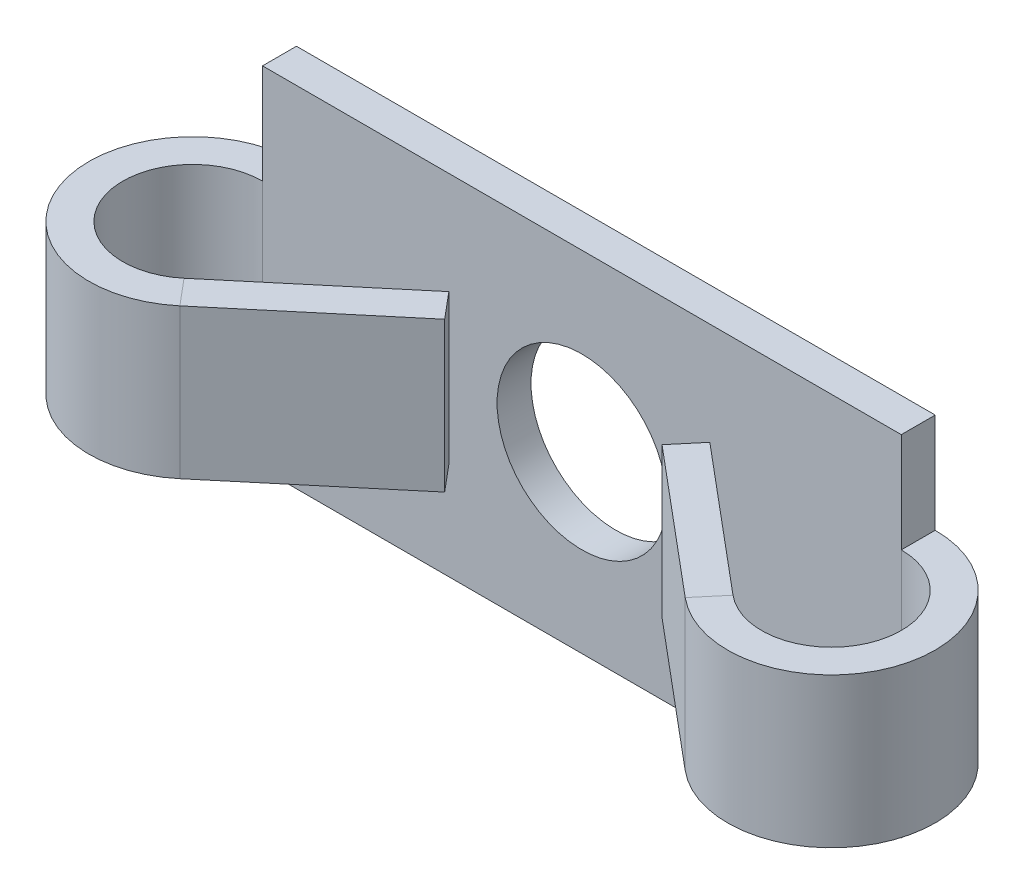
ISO-10303-21;
HEADER;
FILE_DESCRIPTION(('STEP AP214'),'2;1');
FILE_NAME('part.step','',(''),(''),'','','');
FILE_SCHEMA(('AUTOMOTIVE_DESIGN { 1 0 10303 214 1 1 1 1 }'));
ENDSEC;
DATA;
#1=APPLICATION_CONTEXT('core data for automotive mechanical design processes');
#2=APPLICATION_PROTOCOL_DEFINITION('international standard','automotive_design',2000,#1);
#3=PRODUCT_CONTEXT('',#1,'mechanical');
#4=PRODUCT('Part','Part','',(#3));
#5=PRODUCT_RELATED_PRODUCT_CATEGORY('part','',(#4));
#6=PRODUCT_DEFINITION_FORMATION('','',#4);
#7=PRODUCT_DEFINITION_CONTEXT('part definition',#1,'design');
#8=PRODUCT_DEFINITION('design','',#6,#7);
#9=PRODUCT_DEFINITION_SHAPE('','',#8);
#10=(LENGTH_UNIT() NAMED_UNIT(*) SI_UNIT(.MILLI.,.METRE.));
#11=(NAMED_UNIT(*) PLANE_ANGLE_UNIT() SI_UNIT($,.RADIAN.));
#12=(NAMED_UNIT(*) SI_UNIT($,.STERADIAN.) SOLID_ANGLE_UNIT());
#13=UNCERTAINTY_MEASURE_WITH_UNIT(LENGTH_MEASURE(1.E-05),#10,'distance_accuracy_value','');
#14=(GEOMETRIC_REPRESENTATION_CONTEXT(3) GLOBAL_UNCERTAINTY_ASSIGNED_CONTEXT((#13)) GLOBAL_UNIT_ASSIGNED_CONTEXT((#10,
#11,#12)) REPRESENTATION_CONTEXT('',''));
#15=CARTESIAN_POINT('',(0.,0.,0.));
#16=DIRECTION('',(0.,0.,1.));
#17=DIRECTION('',(1.,0.,0.));
#18=AXIS2_PLACEMENT_3D('',#15,#16,#17);
#19=CARTESIAN_POINT('',(-5.44429898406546,0.,1.43083307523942));
#20=DIRECTION('',(-0.766044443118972,0.,0.642787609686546));
#21=DIRECTION('',(0.,-1.,0.));
#22=AXIS2_PLACEMENT_3D('',#19,#20,#21);
#23=PLANE('',#22);
#24=DIRECTION('',(0.,1.,0.));
#25=VECTOR('',#24,1.);
#26=CARTESIAN_POINT('',(-6.53703792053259,0.,0.128557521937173));
#27=LINE('',#26,#25);
#28=CARTESIAN_POINT('',(-6.53703792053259,3.75,0.128557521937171));
#29=VERTEX_POINT('',#28);
#30=CARTESIAN_POINT('',(-6.53703792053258,-3.75,0.12855752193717));
#31=VERTEX_POINT('',#30);
#32=EDGE_CURVE('E188',#29,#31,#27,.F.);
#33=ORIENTED_EDGE('',*,*,#32,.F.);
#34=DIRECTION('',(-0.642787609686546,0.,-0.766044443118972));
#35=VECTOR('',#34,1.);
#36=CARTESIAN_POINT('',(-6.53703792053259,3.75,0.128557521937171));
#37=LINE('',#36,#35);
#38=CARTESIAN_POINT('',(-5.44429898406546,3.75,1.43083307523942));
#39=VERTEX_POINT('',#38);
#40=EDGE_CURVE('E174',#29,#39,#37,.F.);
#41=ORIENTED_EDGE('',*,*,#40,.T.);
#42=DIRECTION('',(0.,-1.,0.));
#43=VECTOR('',#42,1.);
#44=CARTESIAN_POINT('',(-5.44429898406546,0.,1.43083307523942));
#45=LINE('',#44,#43);
#46=CARTESIAN_POINT('',(-5.44429898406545,-3.75,1.43083307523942));
#47=VERTEX_POINT('',#46);
#48=EDGE_CURVE('E182',#39,#47,#45,.T.);
#49=ORIENTED_EDGE('',*,*,#48,.T.);
#50=DIRECTION('',(0.642787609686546,0.,0.766044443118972));
#51=VECTOR('',#50,1.);
#52=CARTESIAN_POINT('',(-5.44429898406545,-3.75,1.43083307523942));
#53=LINE('',#52,#51);
#54=EDGE_CURVE('E620',#47,#31,#53,.F.);
#55=ORIENTED_EDGE('',*,*,#54,.T.);
#56=EDGE_LOOP('',(#33,#41,#49,#55));
#57=FACE_BOUND('',#56,.T.);
#58=ADVANCED_FACE('F35',(#57),#23,.F.);
#59=CARTESIAN_POINT('',(-9.05090170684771,0.,4.45713208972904));
#60=DIRECTION('',(0.642787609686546,0.,0.766044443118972));
#61=DIRECTION('',(0.766044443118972,0.,-0.642787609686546));
#62=AXIS2_PLACEMENT_3D('',#59,#60,#61);
#63=PLANE('',#62);
#64=ORIENTED_EDGE('',*,*,#48,.F.);
#65=DIRECTION('',(0.766044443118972,0.,-0.642787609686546));
#66=VECTOR('',#65,1.);
#67=CARTESIAN_POINT('',(-9.05090170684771,3.75,4.45713208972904));
#68=LINE('',#67,#66);
#69=CARTESIAN_POINT('',(-12.65750442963,3.75,7.48343110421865));
#70=VERTEX_POINT('',#69);
#71=EDGE_CURVE('E170',#70,#39,#68,.T.);
#72=ORIENTED_EDGE('',*,*,#71,.F.);
#73=DIRECTION('',(0.,1.,0.));
#74=VECTOR('',#73,1.);
#75=CARTESIAN_POINT('',(-12.65750442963,0.,7.48343110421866));
#76=LINE('',#75,#74);
#77=CARTESIAN_POINT('',(-12.65750442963,-3.75,7.48343110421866));
#78=VERTEX_POINT('',#77);
#79=EDGE_CURVE('E181',#78,#70,#76,.T.);
#80=ORIENTED_EDGE('',*,*,#79,.F.);
#81=DIRECTION('',(-0.766044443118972,0.,0.642787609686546));
#82=VECTOR('',#81,1.);
#83=CARTESIAN_POINT('',(-9.05090170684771,-3.75,4.45713208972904));
#84=LINE('',#83,#82);
#85=EDGE_CURVE('E664',#47,#78,#84,.T.);
#86=ORIENTED_EDGE('',*,*,#85,.F.);
#87=EDGE_LOOP('',(#64,#72,#80,#86));
#88=FACE_BOUND('',#87,.T.);
#89=ADVANCED_FACE('F179',(#88),#63,.T.);
#90=CARTESIAN_POINT('',(-10.1436406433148,0.,3.15485653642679));
#91=DIRECTION('',(0.642787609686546,0.,0.766044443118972));
#92=DIRECTION('',(0.766044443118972,0.,-0.642787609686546));
#93=AXIS2_PLACEMENT_3D('',#90,#91,#92);
#94=PLANE('',#93);
#95=DIRECTION('',(0.766044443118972,0.,-0.642787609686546));
#96=VECTOR('',#95,1.);
#97=CARTESIAN_POINT('',(-10.1436406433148,3.75,3.15485653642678));
#98=LINE('',#97,#96);
#99=CARTESIAN_POINT('',(-13.7502433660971,3.75,6.1811555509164));
#100=VERTEX_POINT('',#99);
#101=EDGE_CURVE('E173',#100,#29,#98,.T.);
#102=ORIENTED_EDGE('',*,*,#101,.T.);
#103=ORIENTED_EDGE('',*,*,#32,.T.);
#104=DIRECTION('',(0.766044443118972,0.,-0.642787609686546));
#105=VECTOR('',#104,1.);
#106=CARTESIAN_POINT('',(-10.1436406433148,-3.75,3.15485653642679));
#107=LINE('',#106,#105);
#108=CARTESIAN_POINT('',(-13.7502433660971,-3.75,6.18115555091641));
#109=VERTEX_POINT('',#108);
#110=EDGE_CURVE('E666',#31,#109,#107,.F.);
#111=ORIENTED_EDGE('',*,*,#110,.T.);
#112=DIRECTION('',(0.,1.,0.));
#113=VECTOR('',#112,1.);
#114=CARTESIAN_POINT('',(-13.7502433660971,0.,6.1811555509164));
#115=LINE('',#114,#113);
#116=EDGE_CURVE('E192',#109,#100,#115,.T.);
#117=ORIENTED_EDGE('',*,*,#116,.T.);
#118=EDGE_LOOP('',(#102,#103,#111,#117));
#119=FACE_BOUND('',#118,.T.);
#120=ADVANCED_FACE('F268',(#119),#94,.F.);
#121=CARTESIAN_POINT('',(-16.,-8.75,3.49999999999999));
#122=DIRECTION('',(0.,-1.,0.));
#123=DIRECTION('',(0.642787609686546,0.,0.766044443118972));
#124=AXIS2_PLACEMENT_3D('',#121,#122,#123);
#125=CYLINDRICAL_SURFACE('',#124,5.2);
#126=CARTESIAN_POINT('',(-16.,3.75,3.49999999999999));
#127=DIRECTION('',(0.,-1.,0.));
#128=DIRECTION('',(1.,0.,0.));
#129=AXIS2_PLACEMENT_3D('',#126,#127,#128);
#130=CIRCLE('',#129,5.2);
#131=CARTESIAN_POINT('',(-16.,3.75,-1.70000000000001));
#132=VERTEX_POINT('',#131);
#133=EDGE_CURVE('E153',#132,#70,#130,.F.);
#134=ORIENTED_EDGE('',*,*,#133,.F.);
#135=DIRECTION('',(0.,-1.,0.));
#136=VECTOR('',#135,1.);
#137=CARTESIAN_POINT('',(-16.,8.75,-1.7));
#138=LINE('',#137,#136);
#139=CARTESIAN_POINT('',(-16.,-3.75,-1.70000000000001));
#140=VERTEX_POINT('',#139);
#141=EDGE_CURVE('E207',#132,#140,#138,.T.);
#142=ORIENTED_EDGE('',*,*,#141,.T.);
#143=CARTESIAN_POINT('',(-16.,-3.75,3.49999999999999));
#144=DIRECTION('',(0.,1.,0.));
#145=DIRECTION('',(-1.,0.,0.));
#146=AXIS2_PLACEMENT_3D('',#143,#144,#145);
#147=CIRCLE('',#146,5.2);
#148=EDGE_CURVE('E186',#78,#140,#147,.F.);
#149=ORIENTED_EDGE('',*,*,#148,.F.);
#150=ORIENTED_EDGE('',*,*,#79,.T.);
#151=EDGE_LOOP('',(#134,#142,#149,#150));
#152=FACE_BOUND('',#151,.T.);
#153=ADVANCED_FACE('F184',(#152),#125,.T.);
#154=CARTESIAN_POINT('',(-16.,-8.75,3.49999999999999));
#155=DIRECTION('',(0.,-1.,0.));
#156=DIRECTION('',(0.642787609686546,0.,0.766044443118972));
#157=AXIS2_PLACEMENT_3D('',#154,#155,#156);
#158=CYLINDRICAL_SURFACE('',#157,3.5);
#159=DIRECTION('',(0.,-1.,0.));
#160=VECTOR('',#159,1.);
#161=CARTESIAN_POINT('',(-16.,8.75,0.));
#162=LINE('',#161,#160);
#163=CARTESIAN_POINT('',(-16.,3.75,0.));
#164=VERTEX_POINT('',#163);
#165=CARTESIAN_POINT('',(-16.,-3.75,0.));
#166=VERTEX_POINT('',#165);
#167=EDGE_CURVE('E201',#164,#166,#162,.T.);
#168=ORIENTED_EDGE('',*,*,#167,.F.);
#169=CARTESIAN_POINT('',(-16.,3.75,3.49999999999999));
#170=DIRECTION('',(0.,-1.,0.));
#171=DIRECTION('',(0.,0.,-1.));
#172=AXIS2_PLACEMENT_3D('',#169,#170,#171);
#173=CIRCLE('',#172,3.5);
#174=EDGE_CURVE('E164',#164,#100,#173,.F.);
#175=ORIENTED_EDGE('',*,*,#174,.T.);
#176=ORIENTED_EDGE('',*,*,#116,.F.);
#177=CARTESIAN_POINT('',(-16.,-3.75,3.49999999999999));
#178=DIRECTION('',(0.,-1.,0.));
#179=DIRECTION('',(0.,0.,-1.));
#180=AXIS2_PLACEMENT_3D('',#177,#178,#179);
#181=CIRCLE('',#180,3.5);
#182=EDGE_CURVE('E662',#109,#166,#181,.T.);
#183=ORIENTED_EDGE('',*,*,#182,.T.);
#184=EDGE_LOOP('',(#168,#175,#176,#183));
#185=FACE_BOUND('',#184,.T.);
#186=ADVANCED_FACE('F435',(#185),#158,.F.);
#187=CARTESIAN_POINT('',(5.44429898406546,0.,1.43083307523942));
#188=DIRECTION('',(0.766044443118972,0.,0.642787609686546));
#189=DIRECTION('',(0.,1.,0.));
#190=AXIS2_PLACEMENT_3D('',#187,#188,#189);
#191=PLANE('',#190);
#192=DIRECTION('',(0.,1.,0.));
#193=VECTOR('',#192,1.);
#194=CARTESIAN_POINT('',(5.44429898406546,0.,1.43083307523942));
#195=LINE('',#194,#193);
#196=CARTESIAN_POINT('',(5.44429898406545,-3.74999999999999,1.43083307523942));
#197=VERTEX_POINT('',#196);
#198=CARTESIAN_POINT('',(5.44429898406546,3.74999999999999,1.43083307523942));
#199=VERTEX_POINT('',#198);
#200=EDGE_CURVE('E197',#197,#199,#195,.T.);
#201=ORIENTED_EDGE('',*,*,#200,.T.);
#202=DIRECTION('',(-0.642787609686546,0.,0.766044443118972));
#203=VECTOR('',#202,1.);
#204=CARTESIAN_POINT('',(5.44429898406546,3.74999999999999,1.43083307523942));
#205=LINE('',#204,#203);
#206=CARTESIAN_POINT('',(6.53703792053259,3.74999999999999,0.128557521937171));
#207=VERTEX_POINT('',#206);
#208=EDGE_CURVE('E653',#199,#207,#205,.F.);
#209=ORIENTED_EDGE('',*,*,#208,.T.);
#210=DIRECTION('',(0.,1.,0.));
#211=VECTOR('',#210,1.);
#212=CARTESIAN_POINT('',(6.53703792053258,0.,0.128557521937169));
#213=LINE('',#212,#211);
#214=CARTESIAN_POINT('',(6.53703792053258,-3.74999999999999,0.128557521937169));
#215=VERTEX_POINT('',#214);
#216=EDGE_CURVE('E640',#215,#207,#213,.T.);
#217=ORIENTED_EDGE('',*,*,#216,.F.);
#218=DIRECTION('',(0.642787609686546,0.,-0.766044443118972));
#219=VECTOR('',#218,1.);
#220=CARTESIAN_POINT('',(6.53703792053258,-3.74999999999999,0.128557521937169));
#221=LINE('',#220,#219);
#222=EDGE_CURVE('E631',#215,#197,#221,.F.);
#223=ORIENTED_EDGE('',*,*,#222,.T.);
#224=EDGE_LOOP('',(#201,#209,#217,#223));
#225=FACE_BOUND('',#224,.T.);
#226=ADVANCED_FACE('F445',(#225),#191,.F.);
#227=CARTESIAN_POINT('',(9.05090170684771,0.,4.45713208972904));
#228=DIRECTION('',(-0.642787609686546,0.,0.766044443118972));
#229=DIRECTION('',(0.766044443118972,0.,0.642787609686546));
#230=AXIS2_PLACEMENT_3D('',#227,#228,#229);
#231=PLANE('',#230);
#232=DIRECTION('',(0.,-1.,0.));
#233=VECTOR('',#232,1.);
#234=CARTESIAN_POINT('',(12.65750442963,0.,7.48343110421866));
#235=LINE('',#234,#233);
#236=CARTESIAN_POINT('',(12.65750442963,3.74999999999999,7.48343110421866));
#237=VERTEX_POINT('',#236);
#238=CARTESIAN_POINT('',(12.65750442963,-3.74999999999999,7.48343110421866));
#239=VERTEX_POINT('',#238);
#240=EDGE_CURVE('E638',#237,#239,#235,.T.);
#241=ORIENTED_EDGE('',*,*,#240,.F.);
#242=DIRECTION('',(0.766044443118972,0.,0.642787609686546));
#243=VECTOR('',#242,1.);
#244=CARTESIAN_POINT('',(9.05090170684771,3.74999999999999,4.45713208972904));
#245=LINE('',#244,#243);
#246=EDGE_CURVE('E602',#199,#237,#245,.T.);
#247=ORIENTED_EDGE('',*,*,#246,.F.);
#248=ORIENTED_EDGE('',*,*,#200,.F.);
#249=DIRECTION('',(0.766044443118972,0.,0.642787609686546));
#250=VECTOR('',#249,1.);
#251=CARTESIAN_POINT('',(9.05090170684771,-3.74999999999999,4.45713208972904));
#252=LINE('',#251,#250);
#253=EDGE_CURVE('E626',#239,#197,#252,.F.);
#254=ORIENTED_EDGE('',*,*,#253,.F.);
#255=EDGE_LOOP('',(#241,#247,#248,#254));
#256=FACE_BOUND('',#255,.T.);
#257=ADVANCED_FACE('F456',(#256),#231,.T.);
#258=CARTESIAN_POINT('',(10.1436406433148,0.,3.15485653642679));
#259=DIRECTION('',(-0.642787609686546,0.,0.766044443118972));
#260=DIRECTION('',(0.766044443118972,0.,0.642787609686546));
#261=AXIS2_PLACEMENT_3D('',#258,#259,#260);
#262=PLANE('',#261);
#263=DIRECTION('',(0.766044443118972,0.,0.642787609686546));
#264=VECTOR('',#263,1.);
#265=CARTESIAN_POINT('',(10.1436406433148,3.74999999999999,3.15485653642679));
#266=LINE('',#265,#264);
#267=CARTESIAN_POINT('',(13.7502433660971,3.74999999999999,6.1811555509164));
#268=VERTEX_POINT('',#267);
#269=EDGE_CURVE('E645',#207,#268,#266,.T.);
#270=ORIENTED_EDGE('',*,*,#269,.T.);
#271=DIRECTION('',(0.,1.,0.));
#272=VECTOR('',#271,1.);
#273=CARTESIAN_POINT('',(13.7502433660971,0.,6.1811555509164));
#274=LINE('',#273,#272);
#275=CARTESIAN_POINT('',(13.7502433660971,-3.74999999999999,6.1811555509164));
#276=VERTEX_POINT('',#275);
#277=EDGE_CURVE('E598',#268,#276,#274,.F.);
#278=ORIENTED_EDGE('',*,*,#277,.T.);
#279=DIRECTION('',(-0.766044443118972,0.,-0.642787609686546));
#280=VECTOR('',#279,1.);
#281=CARTESIAN_POINT('',(10.1436406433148,-3.74999999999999,3.15485653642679));
#282=LINE('',#281,#280);
#283=EDGE_CURVE('E624',#276,#215,#282,.T.);
#284=ORIENTED_EDGE('',*,*,#283,.T.);
#285=ORIENTED_EDGE('',*,*,#216,.T.);
#286=EDGE_LOOP('',(#270,#278,#284,#285));
#287=FACE_BOUND('',#286,.T.);
#288=ADVANCED_FACE('F467',(#287),#262,.F.);
#289=CARTESIAN_POINT('',(16.,8.75,3.50000000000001));
#290=DIRECTION('',(0.,1.,0.));
#291=DIRECTION('',(-0.642787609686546,0.,0.766044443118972));
#292=AXIS2_PLACEMENT_3D('',#289,#290,#291);
#293=CYLINDRICAL_SURFACE('',#292,5.19999999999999);
#294=DIRECTION('',(0.,1.,0.));
#295=VECTOR('',#294,1.);
#296=CARTESIAN_POINT('',(16.,8.75,-1.7));
#297=LINE('',#296,#295);
#298=CARTESIAN_POINT('',(16.,-3.74999999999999,-1.69999999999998));
#299=VERTEX_POINT('',#298);
#300=CARTESIAN_POINT('',(16.,3.74999999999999,-1.69999999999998));
#301=VERTEX_POINT('',#300);
#302=EDGE_CURVE('E210',#299,#301,#297,.T.);
#303=ORIENTED_EDGE('',*,*,#302,.T.);
#304=CARTESIAN_POINT('',(16.,3.74999999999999,3.50000000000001));
#305=DIRECTION('',(0.,-1.,0.));
#306=DIRECTION('',(1.,0.,0.));
#307=AXIS2_PLACEMENT_3D('',#304,#305,#306);
#308=CIRCLE('',#307,5.19999999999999);
#309=EDGE_CURVE('E603',#237,#301,#308,.F.);
#310=ORIENTED_EDGE('',*,*,#309,.F.);
#311=ORIENTED_EDGE('',*,*,#240,.T.);
#312=CARTESIAN_POINT('',(16.,-3.74999999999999,3.50000000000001));
#313=DIRECTION('',(0.,1.,0.));
#314=DIRECTION('',(-1.,0.,0.));
#315=AXIS2_PLACEMENT_3D('',#312,#313,#314);
#316=CIRCLE('',#315,5.19999999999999);
#317=EDGE_CURVE('E615',#299,#239,#316,.F.);
#318=ORIENTED_EDGE('',*,*,#317,.F.);
#319=EDGE_LOOP('',(#303,#310,#311,#318));
#320=FACE_BOUND('',#319,.T.);
#321=ADVANCED_FACE('F478',(#320),#293,.T.);
#322=CARTESIAN_POINT('',(16.,8.75,3.50000000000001));
#323=DIRECTION('',(0.,1.,0.));
#324=DIRECTION('',(-0.642787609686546,0.,0.766044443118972));
#325=AXIS2_PLACEMENT_3D('',#322,#323,#324);
#326=CYLINDRICAL_SURFACE('',#325,3.49999999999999);
#327=CARTESIAN_POINT('',(16.,3.74999999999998,3.50000000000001));
#328=DIRECTION('',(0.,1.,0.));
#329=DIRECTION('',(0.,0.,1.));
#330=AXIS2_PLACEMENT_3D('',#327,#328,#329);
#331=CIRCLE('',#330,3.49999999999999);
#332=CARTESIAN_POINT('',(16.,3.74999999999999,0.));
#333=VERTEX_POINT('',#332);
#334=EDGE_CURVE('E595',#268,#333,#331,.T.);
#335=ORIENTED_EDGE('',*,*,#334,.T.);
#336=DIRECTION('',(0.,1.,0.));
#337=VECTOR('',#336,1.);
#338=CARTESIAN_POINT('',(16.,8.75,0.));
#339=LINE('',#338,#337);
#340=CARTESIAN_POINT('',(16.,-3.74999999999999,0.));
#341=VERTEX_POINT('',#340);
#342=EDGE_CURVE('E223',#341,#333,#339,.T.);
#343=ORIENTED_EDGE('',*,*,#342,.F.);
#344=CARTESIAN_POINT('',(16.,-3.74999999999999,3.50000000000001));
#345=DIRECTION('',(0.,1.,0.));
#346=DIRECTION('',(0.,0.,1.));
#347=AXIS2_PLACEMENT_3D('',#344,#345,#346);
#348=CIRCLE('',#347,3.49999999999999);
#349=EDGE_CURVE('E52',#341,#276,#348,.F.);
#350=ORIENTED_EDGE('',*,*,#349,.T.);
#351=ORIENTED_EDGE('',*,*,#277,.F.);
#352=EDGE_LOOP('',(#335,#343,#350,#351));
#353=FACE_BOUND('',#352,.T.);
#354=ADVANCED_FACE('F260',(#353),#326,.F.);
#355=CARTESIAN_POINT('',(-16.,8.75,-1.7));
#356=DIRECTION('',(0.,1.,0.));
#357=DIRECTION('',(0.,0.,1.));
#358=AXIS2_PLACEMENT_3D('',#355,#356,#357);
#359=PLANE('',#358);
#360=DIRECTION('',(-1.,0.,0.));
#361=VECTOR('',#360,1.);
#362=CARTESIAN_POINT('',(-16.,8.75,0.));
#363=LINE('',#362,#361);
#364=CARTESIAN_POINT('',(16.,8.74999999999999,0.));
#365=VERTEX_POINT('',#364);
#366=CARTESIAN_POINT('',(-16.,8.75,0.));
#367=VERTEX_POINT('',#366);
#368=EDGE_CURVE('E227',#365,#367,#363,.T.);
#369=ORIENTED_EDGE('',*,*,#368,.F.);
#370=DIRECTION('',(0.,0.,1.));
#371=VECTOR('',#370,1.);
#372=CARTESIAN_POINT('',(16.,8.75,-1.7));
#373=LINE('',#372,#371);
#374=CARTESIAN_POINT('',(16.,8.75,-1.7));
#375=VERTEX_POINT('',#374);
#376=EDGE_CURVE('E44',#375,#365,#373,.T.);
#377=ORIENTED_EDGE('',*,*,#376,.F.);
#378=DIRECTION('',(-1.,0.,0.));
#379=VECTOR('',#378,1.);
#380=CARTESIAN_POINT('',(-16.,8.75,-1.7));
#381=LINE('',#380,#379);
#382=CARTESIAN_POINT('',(-16.,8.75,-1.70000000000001));
#383=VERTEX_POINT('',#382);
#384=EDGE_CURVE('E214',#375,#383,#381,.T.);
#385=ORIENTED_EDGE('',*,*,#384,.T.);
#386=DIRECTION('',(0.,0.,1.));
#387=VECTOR('',#386,1.);
#388=CARTESIAN_POINT('',(-16.,8.75,-1.7));
#389=LINE('',#388,#387);
#390=EDGE_CURVE('E11',#383,#367,#389,.T.);
#391=ORIENTED_EDGE('',*,*,#390,.T.);
#392=EDGE_LOOP('',(#369,#377,#385,#391));
#393=FACE_BOUND('',#392,.T.);
#394=ADVANCED_FACE('F253',(#393),#359,.T.);
#395=CARTESIAN_POINT('',(-16.,-8.75,-1.7));
#396=DIRECTION('',(0.,-1.,0.));
#397=DIRECTION('',(0.,0.,-1.));
#398=AXIS2_PLACEMENT_3D('',#395,#396,#397);
#399=PLANE('',#398);
#400=DIRECTION('',(1.,0.,0.));
#401=VECTOR('',#400,1.);
#402=CARTESIAN_POINT('',(-16.,-8.75,0.));
#403=LINE('',#402,#401);
#404=CARTESIAN_POINT('',(-16.,-8.75,0.));
#405=VERTEX_POINT('',#404);
#406=CARTESIAN_POINT('',(16.,-8.75,0.));
#407=VERTEX_POINT('',#406);
#408=EDGE_CURVE('E220',#405,#407,#403,.T.);
#409=ORIENTED_EDGE('',*,*,#408,.F.);
#410=DIRECTION('',(0.,0.,1.));
#411=VECTOR('',#410,1.);
#412=CARTESIAN_POINT('',(-16.,-8.75,-1.7));
#413=LINE('',#412,#411);
#414=CARTESIAN_POINT('',(-16.,-8.75,-1.70000000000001));
#415=VERTEX_POINT('',#414);
#416=EDGE_CURVE('E39',#415,#405,#413,.T.);
#417=ORIENTED_EDGE('',*,*,#416,.F.);
#418=DIRECTION('',(1.,0.,0.));
#419=VECTOR('',#418,1.);
#420=CARTESIAN_POINT('',(-16.,-8.75,-1.7));
#421=LINE('',#420,#419);
#422=CARTESIAN_POINT('',(16.,-8.75,-1.69999999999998));
#423=VERTEX_POINT('',#422);
#424=EDGE_CURVE('E206',#415,#423,#421,.T.);
#425=ORIENTED_EDGE('',*,*,#424,.T.);
#426=DIRECTION('',(0.,0.,1.));
#427=VECTOR('',#426,1.);
#428=CARTESIAN_POINT('',(16.,-8.75,-1.7));
#429=LINE('',#428,#427);
#430=EDGE_CURVE('E230',#423,#407,#429,.T.);
#431=ORIENTED_EDGE('',*,*,#430,.T.);
#432=EDGE_LOOP('',(#409,#417,#425,#431));
#433=FACE_BOUND('',#432,.T.);
#434=ADVANCED_FACE('F37',(#433),#399,.T.);
#435=CARTESIAN_POINT('',(0.,0.,-1.7));
#436=DIRECTION('',(0.,0.,1.));
#437=DIRECTION('',(1.,0.,0.));
#438=AXIS2_PLACEMENT_3D('',#435,#436,#437);
#439=PLANE('',#438);
#440=CARTESIAN_POINT('',(0.,0.,-1.7));
#441=DIRECTION('',(0.,0.,1.));
#442=DIRECTION('',(1.,0.,0.));
#443=AXIS2_PLACEMENT_3D('',#440,#441,#442);
#444=CIRCLE('',#443,4.25);
#445=CARTESIAN_POINT('',(4.25,0.,-1.7));
#446=VERTEX_POINT('',#445);
#447=EDGE_CURVE('E198',#446,#446,#444,.T.);
#448=ORIENTED_EDGE('',*,*,#447,.T.);
#449=EDGE_LOOP('',(#448));
#450=FACE_BOUND('',#449,.T.);
#451=EDGE_CURVE('E204',#383,#132,#138,.T.);
#452=ORIENTED_EDGE('',*,*,#451,.F.);
#453=ORIENTED_EDGE('',*,*,#384,.F.);
#454=DIRECTION('',(0.,1.,0.));
#455=VECTOR('',#454,1.);
#456=CARTESIAN_POINT('',(16.,8.75,-1.69999999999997));
#457=LINE('',#456,#455);
#458=EDGE_CURVE('E61',#375,#301,#457,.F.);
#459=ORIENTED_EDGE('',*,*,#458,.T.);
#460=ORIENTED_EDGE('',*,*,#302,.F.);
#461=EDGE_CURVE('E211',#423,#299,#297,.T.);
#462=ORIENTED_EDGE('',*,*,#461,.F.);
#463=ORIENTED_EDGE('',*,*,#424,.F.);
#464=DIRECTION('',(0.,-1.,0.));
#465=VECTOR('',#464,1.);
#466=CARTESIAN_POINT('',(-16.,-8.75,-1.70000000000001));
#467=LINE('',#466,#465);
#468=EDGE_CURVE('E243',#415,#140,#467,.F.);
#469=ORIENTED_EDGE('',*,*,#468,.T.);
#470=ORIENTED_EDGE('',*,*,#141,.F.);
#471=EDGE_LOOP('',(#452,#453,#459,#460,#462,#463,#469,#470));
#472=FACE_BOUND('',#471,.T.);
#473=ADVANCED_FACE('F252',(#450,#472),#439,.F.);
#474=CARTESIAN_POINT('',(0.,0.,0.));
#475=DIRECTION('',(0.,0.,1.));
#476=DIRECTION('',(1.,0.,0.));
#477=AXIS2_PLACEMENT_3D('',#474,#475,#476);
#478=PLANE('',#477);
#479=CARTESIAN_POINT('',(0.,0.,0.));
#480=DIRECTION('',(0.,0.,1.));
#481=DIRECTION('',(1.,0.,0.));
#482=AXIS2_PLACEMENT_3D('',#479,#480,#481);
#483=CIRCLE('',#482,4.25);
#484=CARTESIAN_POINT('',(4.25,0.,0.));
#485=VERTEX_POINT('',#484);
#486=EDGE_CURVE('E190',#485,#485,#483,.T.);
#487=ORIENTED_EDGE('',*,*,#486,.F.);
#488=EDGE_LOOP('',(#487));
#489=FACE_BOUND('',#488,.T.);
#490=EDGE_CURVE('E217',#367,#164,#162,.T.);
#491=ORIENTED_EDGE('',*,*,#490,.T.);
#492=ORIENTED_EDGE('',*,*,#167,.T.);
#493=DIRECTION('',(0.,-1.,0.));
#494=VECTOR('',#493,1.);
#495=CARTESIAN_POINT('',(-16.,-8.75,0.));
#496=LINE('',#495,#494);
#497=EDGE_CURVE('E240',#405,#166,#496,.F.);
#498=ORIENTED_EDGE('',*,*,#497,.F.);
#499=ORIENTED_EDGE('',*,*,#408,.T.);
#500=EDGE_CURVE('E224',#407,#341,#339,.T.);
#501=ORIENTED_EDGE('',*,*,#500,.T.);
#502=ORIENTED_EDGE('',*,*,#342,.T.);
#503=DIRECTION('',(0.,1.,0.));
#504=VECTOR('',#503,1.);
#505=CARTESIAN_POINT('',(16.,8.75,0.));
#506=LINE('',#505,#504);
#507=EDGE_CURVE('E606',#365,#333,#506,.F.);
#508=ORIENTED_EDGE('',*,*,#507,.F.);
#509=ORIENTED_EDGE('',*,*,#368,.T.);
#510=EDGE_LOOP('',(#491,#492,#498,#499,#501,#502,#508,#509));
#511=FACE_BOUND('',#510,.T.);
#512=ADVANCED_FACE('F246',(#489,#511),#478,.T.);
#513=CARTESIAN_POINT('',(0.,0.,-1.7));
#514=DIRECTION('',(0.,0.,1.));
#515=DIRECTION('',(1.,0.,0.));
#516=AXIS2_PLACEMENT_3D('',#513,#514,#515);
#517=CYLINDRICAL_SURFACE('',#516,4.25);
#518=ORIENTED_EDGE('',*,*,#447,.F.);
#519=EDGE_LOOP('',(#518));
#520=FACE_BOUND('',#519,.T.);
#521=ORIENTED_EDGE('',*,*,#486,.T.);
#522=EDGE_LOOP('',(#521));
#523=FACE_BOUND('',#522,.T.);
#524=ADVANCED_FACE('F273',(#520,#523),#517,.F.);
#525=CARTESIAN_POINT('',(10.1436406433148,-3.74999999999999,3.15485653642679));
#526=DIRECTION('',(0.,1.,0.));
#527=DIRECTION('',(-0.766044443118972,0.,-0.642787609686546));
#528=AXIS2_PLACEMENT_3D('',#525,#526,#527);
#529=PLANE('',#528);
#530=ORIENTED_EDGE('',*,*,#222,.F.);
#531=ORIENTED_EDGE('',*,*,#283,.F.);
#532=DIRECTION('',(0.642787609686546,0.,-0.766044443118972));
#533=VECTOR('',#532,1.);
#534=CARTESIAN_POINT('',(13.7502433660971,-3.74999999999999,6.1811555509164));
#535=LINE('',#534,#533);
#536=EDGE_CURVE('E628',#276,#239,#535,.F.);
#537=ORIENTED_EDGE('',*,*,#536,.T.);
#538=ORIENTED_EDGE('',*,*,#253,.T.);
#539=EDGE_LOOP('',(#530,#531,#537,#538));
#540=FACE_BOUND('',#539,.T.);
#541=ADVANCED_FACE('F275',(#540),#529,.F.);
#542=CARTESIAN_POINT('',(16.,-3.74999999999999,3.50000000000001));
#543=DIRECTION('',(0.,-1.,0.));
#544=DIRECTION('',(1.,0.,0.));
#545=AXIS2_PLACEMENT_3D('',#542,#543,#544);
#546=PLANE('',#545);
#547=ORIENTED_EDGE('',*,*,#349,.F.);
#548=DIRECTION('',(0.,0.,1.));
#549=VECTOR('',#548,1.);
#550=CARTESIAN_POINT('',(16.,-3.74999999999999,0.));
#551=LINE('',#550,#549);
#552=EDGE_CURVE('E612',#341,#299,#551,.F.);
#553=ORIENTED_EDGE('',*,*,#552,.T.);
#554=ORIENTED_EDGE('',*,*,#317,.T.);
#555=ORIENTED_EDGE('',*,*,#536,.F.);
#556=EDGE_LOOP('',(#547,#553,#554,#555));
#557=FACE_BOUND('',#556,.T.);
#558=ADVANCED_FACE('F297',(#557),#546,.T.);
#559=CARTESIAN_POINT('',(16.,-6.24999999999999,0.));
#560=DIRECTION('',(-1.,0.,0.));
#561=DIRECTION('',(0.,1.,0.));
#562=AXIS2_PLACEMENT_3D('',#559,#560,#561);
#563=PLANE('',#562);
#564=ORIENTED_EDGE('',*,*,#500,.F.);
#565=ORIENTED_EDGE('',*,*,#430,.F.);
#566=ORIENTED_EDGE('',*,*,#461,.T.);
#567=ORIENTED_EDGE('',*,*,#552,.F.);
#568=EDGE_LOOP('',(#564,#565,#566,#567));
#569=FACE_BOUND('',#568,.T.);
#570=ADVANCED_FACE('F305',(#569),#563,.F.);
#571=CARTESIAN_POINT('',(-9.05090170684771,-3.75,4.45713208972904));
#572=DIRECTION('',(0.,1.,0.));
#573=DIRECTION('',(-0.766044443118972,0.,0.642787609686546));
#574=AXIS2_PLACEMENT_3D('',#571,#572,#573);
#575=PLANE('',#574);
#576=ORIENTED_EDGE('',*,*,#85,.T.);
#577=DIRECTION('',(0.642787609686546,0.,0.766044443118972));
#578=VECTOR('',#577,1.);
#579=CARTESIAN_POINT('',(-12.65750442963,-3.75,7.48343110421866));
#580=LINE('',#579,#578);
#581=EDGE_CURVE('E616',#78,#109,#580,.F.);
#582=ORIENTED_EDGE('',*,*,#581,.T.);
#583=ORIENTED_EDGE('',*,*,#110,.F.);
#584=ORIENTED_EDGE('',*,*,#54,.F.);
#585=EDGE_LOOP('',(#576,#582,#583,#584));
#586=FACE_BOUND('',#585,.T.);
#587=ADVANCED_FACE('F312',(#586),#575,.F.);
#588=CARTESIAN_POINT('',(-16.,-3.75,3.49999999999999));
#589=DIRECTION('',(0.,-1.,0.));
#590=DIRECTION('',(1.,0.,0.));
#591=AXIS2_PLACEMENT_3D('',#588,#589,#590);
#592=PLANE('',#591);
#593=ORIENTED_EDGE('',*,*,#148,.T.);
#594=DIRECTION('',(0.,0.,1.));
#595=VECTOR('',#594,1.);
#596=CARTESIAN_POINT('',(-16.,-3.75,0.));
#597=LINE('',#596,#595);
#598=EDGE_CURVE('E659',#166,#140,#597,.F.);
#599=ORIENTED_EDGE('',*,*,#598,.F.);
#600=ORIENTED_EDGE('',*,*,#182,.F.);
#601=ORIENTED_EDGE('',*,*,#581,.F.);
#602=EDGE_LOOP('',(#593,#599,#600,#601));
#603=FACE_BOUND('',#602,.T.);
#604=ADVANCED_FACE('F320',(#603),#592,.T.);
#605=CARTESIAN_POINT('',(-16.,-6.25,0.));
#606=DIRECTION('',(1.,0.,0.));
#607=DIRECTION('',(0.,-1.,0.));
#608=AXIS2_PLACEMENT_3D('',#605,#606,#607);
#609=PLANE('',#608);
#610=ORIENTED_EDGE('',*,*,#416,.T.);
#611=ORIENTED_EDGE('',*,*,#497,.T.);
#612=ORIENTED_EDGE('',*,*,#598,.T.);
#613=ORIENTED_EDGE('',*,*,#468,.F.);
#614=EDGE_LOOP('',(#610,#611,#612,#613));
#615=FACE_BOUND('',#614,.T.);
#616=ADVANCED_FACE('F238',(#615),#609,.F.);
#617=CARTESIAN_POINT('',(9.05090170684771,3.74999999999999,4.45713208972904));
#618=DIRECTION('',(0.,-1.,0.));
#619=DIRECTION('',(0.766044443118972,0.,0.642787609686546));
#620=AXIS2_PLACEMENT_3D('',#617,#618,#619);
#621=PLANE('',#620);
#622=ORIENTED_EDGE('',*,*,#246,.T.);
#623=DIRECTION('',(-0.642787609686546,0.,0.766044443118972));
#624=VECTOR('',#623,1.);
#625=CARTESIAN_POINT('',(12.65750442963,3.74999999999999,7.48343110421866));
#626=LINE('',#625,#624);
#627=EDGE_CURVE('E249',#237,#268,#626,.F.);
#628=ORIENTED_EDGE('',*,*,#627,.T.);
#629=ORIENTED_EDGE('',*,*,#269,.F.);
#630=ORIENTED_EDGE('',*,*,#208,.F.);
#631=EDGE_LOOP('',(#622,#628,#629,#630));
#632=FACE_BOUND('',#631,.T.);
#633=ADVANCED_FACE('F335',(#632),#621,.F.);
#634=CARTESIAN_POINT('',(16.,3.74999999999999,3.50000000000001));
#635=DIRECTION('',(0.,1.,0.));
#636=DIRECTION('',(-1.,0.,0.));
#637=AXIS2_PLACEMENT_3D('',#634,#635,#636);
#638=PLANE('',#637);
#639=ORIENTED_EDGE('',*,*,#309,.T.);
#640=DIRECTION('',(0.,0.,1.));
#641=VECTOR('',#640,1.);
#642=CARTESIAN_POINT('',(16.,3.74999999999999,0.));
#643=LINE('',#642,#641);
#644=EDGE_CURVE('E607',#333,#301,#643,.F.);
#645=ORIENTED_EDGE('',*,*,#644,.F.);
#646=ORIENTED_EDGE('',*,*,#334,.F.);
#647=ORIENTED_EDGE('',*,*,#627,.F.);
#648=EDGE_LOOP('',(#639,#645,#646,#647));
#649=FACE_BOUND('',#648,.T.);
#650=ADVANCED_FACE('F341',(#649),#638,.T.);
#651=CARTESIAN_POINT('',(16.,6.24999999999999,0.));
#652=DIRECTION('',(-1.,0.,0.));
#653=DIRECTION('',(0.,1.,0.));
#654=AXIS2_PLACEMENT_3D('',#651,#652,#653);
#655=PLANE('',#654);
#656=ORIENTED_EDGE('',*,*,#376,.T.);
#657=ORIENTED_EDGE('',*,*,#507,.T.);
#658=ORIENTED_EDGE('',*,*,#644,.T.);
#659=ORIENTED_EDGE('',*,*,#458,.F.);
#660=EDGE_LOOP('',(#656,#657,#658,#659));
#661=FACE_BOUND('',#660,.T.);
#662=ADVANCED_FACE('F349',(#661),#655,.F.);
#663=CARTESIAN_POINT('',(-10.1436406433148,3.75,3.15485653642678));
#664=DIRECTION('',(0.,-1.,0.));
#665=DIRECTION('',(0.766044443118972,0.,-0.642787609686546));
#666=AXIS2_PLACEMENT_3D('',#663,#664,#665);
#667=PLANE('',#666);
#668=ORIENTED_EDGE('',*,*,#40,.F.);
#669=ORIENTED_EDGE('',*,*,#101,.F.);
#670=DIRECTION('',(-0.642787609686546,0.,-0.766044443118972));
#671=VECTOR('',#670,1.);
#672=CARTESIAN_POINT('',(-13.7502433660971,3.75,6.1811555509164));
#673=LINE('',#672,#671);
#674=EDGE_CURVE('E156',#100,#70,#673,.F.);
#675=ORIENTED_EDGE('',*,*,#674,.T.);
#676=ORIENTED_EDGE('',*,*,#71,.T.);
#677=EDGE_LOOP('',(#668,#669,#675,#676));
#678=FACE_BOUND('',#677,.T.);
#679=ADVANCED_FACE('F169',(#678),#667,.F.);
#680=CARTESIAN_POINT('',(-16.,3.75,3.49999999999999));
#681=DIRECTION('',(0.,1.,0.));
#682=DIRECTION('',(-1.,0.,0.));
#683=AXIS2_PLACEMENT_3D('',#680,#681,#682);
#684=PLANE('',#683);
#685=ORIENTED_EDGE('',*,*,#174,.F.);
#686=DIRECTION('',(0.,0.,1.));
#687=VECTOR('',#686,1.);
#688=CARTESIAN_POINT('',(-16.,3.75,0.));
#689=LINE('',#688,#687);
#690=EDGE_CURVE('E159',#164,#132,#689,.F.);
#691=ORIENTED_EDGE('',*,*,#690,.T.);
#692=ORIENTED_EDGE('',*,*,#133,.T.);
#693=ORIENTED_EDGE('',*,*,#674,.F.);
#694=EDGE_LOOP('',(#685,#691,#692,#693));
#695=FACE_BOUND('',#694,.T.);
#696=ADVANCED_FACE('F155',(#695),#684,.T.);
#697=CARTESIAN_POINT('',(-16.,6.25,0.));
#698=DIRECTION('',(1.,0.,0.));
#699=DIRECTION('',(0.,-1.,0.));
#700=AXIS2_PLACEMENT_3D('',#697,#698,#699);
#701=PLANE('',#700);
#702=ORIENTED_EDGE('',*,*,#490,.F.);
#703=ORIENTED_EDGE('',*,*,#390,.F.);
#704=ORIENTED_EDGE('',*,*,#451,.T.);
#705=ORIENTED_EDGE('',*,*,#690,.F.);
#706=EDGE_LOOP('',(#702,#703,#704,#705));
#707=FACE_BOUND('',#706,.T.);
#708=ADVANCED_FACE('F369',(#707),#701,.F.);
#709=CLOSED_SHELL('',(#58,#89,#120,#153,#186,#226,#257,#288,#321,#354,#394,#434,#473,#512,#524,
#541,#558,#570,#587,#604,#616,#633,#650,#662,#679,#696,#708));
#710=MANIFOLD_SOLID_BREP('B2',#709);
#711=ADVANCED_BREP_SHAPE_REPRESENTATION('',(#18,#710),#14);
#712=SHAPE_DEFINITION_REPRESENTATION(#9,#711);
ENDSEC;
END-ISO-10303-21;
